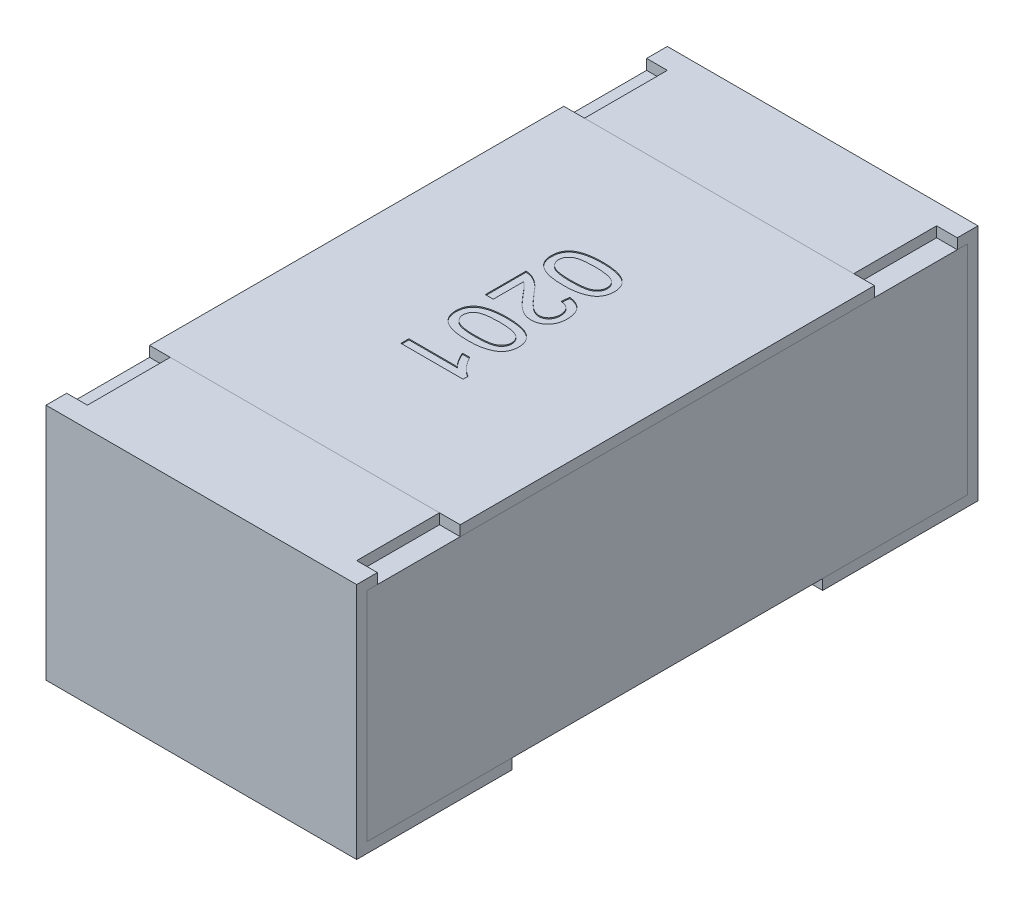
from build123d import *

# Parameters (mm, degrees)
BOSS_EXTRUDE2_DEPTH   = 0.15
BOSS_EXTRUDE2_2_DEPTH = 0.15
BOSS_EXTRUDE3_START   = -0.15
SKETCH5_W             = 0.58
SKETCH5_H             = 0.21
BOSS_EXTRUDE3_DEPTH   = 0.3
SKETCH6_W             = 0.02
SKETCH6_H             = 0.08
CUT_EXTRUDE1_DEPTH    = 0.01
SKETCH7_W             = 0.3
SKETCH7_H             = 0.4
BOSS_EXTRUDE4_DEPTH   = 0.01
TEXT0201_DEPTH        = 0.001


with BuildPart() as part:
    # Sketch4 → Boss-Extrude2 (new, symmetric)
    with BuildSketch(Plane(origin=(0, 0, 0), x_dir=(0, 0, -1), z_dir=(1, 0, 0))):
        Polygon((-0.3, 0.115), (-0.3, -0.115), (-0.15, -0.115), (-0.15, -0.105), (-0.29, -0.105), (-0.29, 0.105), (-0.2, 0.105), (-0.2, 0.115), align=None)
    extrude(amount=BOSS_EXTRUDE2_DEPTH, both=True)


with BuildPart() as body_2:
    # Sketch4 → Boss-Extrude2 2 (new, symmetric)
    with BuildSketch(Plane(origin=(0, 0, 0), x_dir=(0, 0, -1), z_dir=(1, 0, 0))):
        Polygon((0.2, 0.115), (0.3, 0.115), (0.3, -0.115), (0.15, -0.115), (0.15, -0.105), (0.29, -0.105), (0.29, 0.105), (0.2, 0.105), align=None)
    extrude(amount=BOSS_EXTRUDE2_2_DEPTH, both=True)


with BuildPart() as body_3:
    # Sketch5 → Boss-Extrude3 (new body)
    with BuildSketch(Plane(origin=(0, 0, 0), x_dir=(0, 0, -1), z_dir=(1, 0, 0)).offset(BOSS_EXTRUDE3_START)):
        Rectangle(SKETCH5_W, SKETCH5_H)
    extrude(amount=BOSS_EXTRUDE3_DEPTH)


with BuildPart() as cut_extrude1_tool:
    # Sketch6 → Cut-Extrude1 (new body)
    with BuildSketch(Plane(origin=(0, 0.115, 0), x_dir=(1, 0, 0), z_dir=(0, 1, 0))):
        with Locations((-0.14, 0.24)):
            Rectangle(SKETCH6_W, SKETCH6_H)
        with Locations((0.14, 0.24)):
            Rectangle(SKETCH6_W, SKETCH6_H)
        with Locations((0.14, -0.24)):
            Rectangle(SKETCH6_W, SKETCH6_H)
        with Locations((-0.14, -0.24)):
            Rectangle(SKETCH6_W, SKETCH6_H)
    extrude(amount=-CUT_EXTRUDE1_DEPTH)


with BuildPart() as part_1:
    add(part.part)

    # Cut-Extrude1: cut by cut_extrude1_tool
    add(cut_extrude1_tool.part, mode=Mode.SUBTRACT)


with BuildPart() as body_2_1:
    add(body_2.part)

    # Cut-Extrude1: cut by cut_extrude1_tool
    add(cut_extrude1_tool.part, mode=Mode.SUBTRACT)


with BuildPart() as body_4:
    # Sketch7 → Boss-Extrude4 (new body)
    with BuildSketch(Plane(origin=(0, 0.105, 0), x_dir=(1, 0, 0), z_dir=(0, 1, 0))):
        Rectangle(SKETCH7_W, SKETCH7_H)
    extrude(amount=BOSS_EXTRUDE4_DEPTH)

    # Sketch8 → TEXT0201 (cut)
    # profile 1 of 4: a face of its own
    with BuildSketch(Plane(origin=(0, 0.115, 0), x_dir=(1, 0, 0), z_dir=(0, 1, 0))):
        with BuildLine():
            add(Edge.make_bspline(
                [(-0.000766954, 0.088461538), (9.0501e-05, 0.088453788), (0.001769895, 0.088438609), (0.004227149, 0.088344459), (0.006560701, 0.08818008), (0.008768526, 0.087934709), (0.010855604, 0.087644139), (0.012818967, 0.087266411), (0.014662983, 0.086841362), (0.01638586, 0.086331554), (0.018001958, 0.085770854), (0.019510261, 0.085136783), (0.020901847, 0.084417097), (0.022214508, 0.083676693), (0.023386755, 0.082814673), (0.024492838, 0.081940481), (0.02546962, 0.080964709), (0.026349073, 0.079933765), (0.027124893, 0.078830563), (0.027794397, 0.07766144), (0.028385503, 0.07643076), (0.028830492, 0.075115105), (0.029193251, 0.073741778), (0.029460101, 0.07230021), (0.029617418, 0.070788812), (0.029633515, 0.069755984), (0.0296417, 0.069230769)],
                knots=[0, 0, 0, 0, 1.514715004, 2.966688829, 4.343277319, 5.646155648, 6.890271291, 8.064567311, 9.176982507, 10.231801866, 11.236819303, 12.197732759, 13.118802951, 14.00370591, 14.856056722, 15.686168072, 16.491905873, 17.290274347, 18.077650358, 18.870352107, 19.668187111, 20.485160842, 21.319455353, 22.17593919, 23.072426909, 24, 24, 24, 24], degree=3))
            add(Edge.make_bspline(
                [(0.0296417, 0.069230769), (0.029619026, 0.068460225), (0.029574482, 0.066946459), (0.029211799, 0.064736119), (0.028589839, 0.06265391), (0.027757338, 0.060700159), (0.026680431, 0.058917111), (0.025404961, 0.05730507), (0.023877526, 0.05592917), (0.022148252, 0.05474396), (0.020213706, 0.053727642), (0.018092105, 0.052818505), (0.015774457, 0.052003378), (0.013705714, 0.051406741), (0.011916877, 0.050988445), (0.010438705, 0.050733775), (0.008848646, 0.050498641), (0.007142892, 0.050331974), (0.005329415, 0.050162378), (0.003400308, 0.050078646), (0.00135688, 0.050014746), (-4.5738e-05, 0.050005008), (-0.000766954, 0.05)],
                knots=[0, 0, 0, 0, 1.134508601, 2.228787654, 3.287419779, 4.328790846, 5.347871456, 6.346850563, 7.345149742, 8.363256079, 9.427154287, 10.558404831, 11.760335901, 13.043439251, 13.7276639, 14.464993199, 15.251939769, 16.09452972, 16.988861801, 17.934185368, 18.937772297, 20, 20, 20, 20], degree=3))
            add(Edge.make_bspline(
                [(-0.000766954, 0.05), (-0.001620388, 0.050007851), (-0.00328774, 0.050023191), (-0.005725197, 0.050115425), (-0.008041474, 0.050287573), (-0.010239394, 0.050509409), (-0.012320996, 0.050808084), (-0.014281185, 0.051181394), (-0.016122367, 0.051612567), (-0.017846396, 0.052100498), (-0.019455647, 0.052668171), (-0.020957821, 0.053308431), (-0.022367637, 0.053994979), (-0.023658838, 0.05477371), (-0.024852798, 0.055603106), (-0.025953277, 0.056490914), (-0.026944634, 0.057455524), (-0.027821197, 0.058496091), (-0.028610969, 0.059591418), (-0.02928656, 0.060763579), (-0.029850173, 0.062009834), (-0.030321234, 0.063319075), (-0.030679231, 0.064699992), (-0.030945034, 0.066145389), (-0.031103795, 0.067664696), (-0.03111951, 0.068701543), (-0.031127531, 0.069230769)],
                knots=[0, 0, 0, 0, 1.50892112, 2.947974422, 4.311604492, 5.614840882, 6.853004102, 8.028299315, 9.14166105, 10.195403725, 11.194594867, 12.156325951, 13.08133133, 13.964490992, 14.819271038, 15.650088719, 16.461567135, 17.260614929, 18.05275699, 18.846133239, 19.648095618, 20.468123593, 21.303127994, 22.167306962, 23.06455749, 24, 24, 24, 24], degree=3))
            add(Edge.make_bspline(
                [(-0.031127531, 0.069230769), (-0.031107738, 0.069924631), (-0.031069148, 0.071277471), (-0.030806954, 0.073253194), (-0.03034548, 0.075107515), (-0.029726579, 0.076856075), (-0.028898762, 0.078479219), (-0.027891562, 0.079984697), (-0.026728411, 0.081402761), (-0.025810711, 0.082219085), (-0.025346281, 0.082632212)],
                knots=[0, 0, 0, 0, 1.10322584, 2.150986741, 3.161425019, 4.136713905, 5.093944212, 6.049774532, 7.013026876, 8, 8, 8, 8], degree=3))
            add(Edge.make_bspline(
                [(-0.025346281, 0.082632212), (-0.024660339, 0.08310773), (-0.023245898, 0.084088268), (-0.020834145, 0.085235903), (-0.018179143, 0.086259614), (-0.015228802, 0.08706304), (-0.012006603, 0.087692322), (-0.008506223, 0.088146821), (-0.004729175, 0.088404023), (-0.002117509, 0.088441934), (-0.000766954, 0.088461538)],
                knots=[0, 0, 0, 0, 0.779365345, 1.607084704, 2.489375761, 3.438383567, 4.461919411, 5.557722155, 6.737039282, 8, 8, 8, 8], degree=3))
        make_face()
        with BuildLine():
            add(Edge.make_bspline(
                [(-0.000742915, 0.080769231), (-0.001896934, 0.080761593), (-0.00410598, 0.080746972), (-0.007261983, 0.080594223), (-0.010109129, 0.080331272), (-0.012643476, 0.079983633), (-0.014868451, 0.079524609), (-0.016778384, 0.078948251), (-0.0183962, 0.078298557), (-0.019701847, 0.077494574), (-0.020766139, 0.076614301), (-0.021681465, 0.075705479), (-0.022459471, 0.074746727), (-0.023108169, 0.073744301), (-0.023599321, 0.072682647), (-0.023955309, 0.071573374), (-0.024160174, 0.070416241), (-0.02418961, 0.069628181), (-0.024204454, 0.069230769)],
                knots=[0, 0, 0, 0, 1.89448813, 3.626469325, 5.185477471, 6.587276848, 7.82441448, 8.910550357, 9.859733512, 10.6775885, 11.416198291, 12.123144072, 12.791880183, 13.439617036, 14.078171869, 14.70637855, 15.347637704, 16, 16, 16, 16], degree=3))
            add(Edge.make_bspline(
                [(-0.024204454, 0.069230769), (-0.024189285, 0.068833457), (-0.024159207, 0.068045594), (-0.023958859, 0.066885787), (-0.023584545, 0.065780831), (-0.023095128, 0.06472076), (-0.022461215, 0.063711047), (-0.021680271, 0.062757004), (-0.020765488, 0.061843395), (-0.019688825, 0.060967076), (-0.018377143, 0.060169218), (-0.016760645, 0.059507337), (-0.014847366, 0.058939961), (-0.012623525, 0.058478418), (-0.010093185, 0.058129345), (-0.007253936, 0.057867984), (-0.004101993, 0.057714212), (-0.001896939, 0.057699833), (-0.000742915, 0.057692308)],
                knots=[0, 0, 0, 0, 0.652509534, 1.29391342, 1.924290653, 2.562989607, 3.207355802, 3.876242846, 4.583348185, 5.32723334, 6.150888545, 7.094226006, 8.186903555, 9.424320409, 10.81992305, 12.379283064, 14.105084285, 16, 16, 16, 16], degree=3))
            add(Edge.make_bspline(
                [(-0.000742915, 0.057692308), (0.000387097, 0.057699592), (0.002552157, 0.057713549), (0.005647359, 0.057871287), (0.008446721, 0.058118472), (0.010952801, 0.058456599), (0.01316295, 0.058905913), (0.015081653, 0.059451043), (0.01670549, 0.060100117), (0.018048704, 0.060873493), (0.019157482, 0.061730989), (0.02009851, 0.062642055), (0.020923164, 0.063589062), (0.021568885, 0.064626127), (0.02209847, 0.065709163), (0.022452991, 0.066861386), (0.02268052, 0.068067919), (0.022705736, 0.068893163), (0.022718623, 0.069314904)],
                knots=[0, 0, 0, 0, 1.850145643, 3.544809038, 5.072983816, 6.450691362, 7.683229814, 8.76276662, 9.712991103, 10.538891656, 11.292051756, 12.001912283, 12.681449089, 13.342071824, 13.996410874, 14.649960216, 15.310061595, 16, 16, 16, 16], degree=3))
            add(Edge.make_bspline(
                [(0.022718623, 0.069314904), (0.022708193, 0.069712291), (0.022687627, 0.070495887), (0.022491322, 0.071643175), (0.022163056, 0.072730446), (0.021718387, 0.073770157), (0.021119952, 0.074736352), (0.020421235, 0.075667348), (0.019569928, 0.076519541), (0.018933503, 0.077033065), (0.018608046, 0.077295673)],
                knots=[0, 0, 0, 0, 1.021318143, 2.013908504, 2.982026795, 3.937174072, 4.91255697, 5.897578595, 6.924855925, 8, 8, 8, 8], degree=3))
            add(Edge.make_bspline(
                [(0.018608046, 0.077295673), (0.018130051, 0.077581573), (0.017120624, 0.078185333), (0.0153662, 0.078860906), (0.013361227, 0.07945768), (0.011074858, 0.079949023), (0.008511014, 0.080304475), (0.005672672, 0.080585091), (0.002555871, 0.08073086), (0.000387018, 0.080756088), (-0.000742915, 0.080769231)],
                knots=[0, 0, 0, 0, 0.671104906, 1.417232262, 2.260109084, 3.195198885, 4.23592645, 5.382417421, 6.636286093, 8, 8, 8, 8], degree=3))
        make_face(mode=Mode.SUBTRACT)
    # profile 2 of 4: a face of its own
    with BuildSketch(Plane(origin=(0, 0.115, 0), x_dir=(1, 0, 0), z_dir=(0, 1, 0))):
        with BuildLine():
            Line((-0.022665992, 0.004615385), (-0.0303583, 0.004615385))
            Line((-0.0303583, 0.004615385), (-0.0303583, 0.043846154))
            add(Edge.make_bspline(
                [(-0.0303583, 0.043846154), (-0.029901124, 0.043846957), (-0.028988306, 0.043848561), (-0.027638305, 0.043694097), (-0.026306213, 0.043452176), (-0.025451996, 0.043178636), (-0.025021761, 0.043040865)],
                knots=[0, 0, 0, 0, 1.01057331, 2.01775941, 3.001627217, 4, 4, 4, 4], degree=3))
            add(Edge.make_bspline(
                [(-0.025021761, 0.043040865), (-0.024318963, 0.042786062), (-0.02288795, 0.042267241), (-0.020818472, 0.041220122), (-0.018773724, 0.039968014), (-0.017097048, 0.038769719), (-0.01576726, 0.037666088), (-0.01471431, 0.036755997), (-0.013649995, 0.035730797), (-0.012555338, 0.034609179), (-0.011430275, 0.033397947), (-0.010269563, 0.032097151), (-0.009095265, 0.030690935), (-0.008316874, 0.02970927), (-0.007918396, 0.029206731)],
                knots=[0, 0, 0, 0, 1.204749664, 2.453068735, 3.731868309, 5.069624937, 5.772016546, 6.5184395, 7.31363639, 8.154361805, 9.045869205, 9.979533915, 10.965673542, 12, 12, 12, 12], degree=3))
            add(Edge.make_bspline(
                [(-0.007918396, 0.029206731), (-0.007268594, 0.028434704), (-0.006017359, 0.026948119), (-0.004160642, 0.024848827), (-0.002436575, 0.022931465), (-0.000814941, 0.021226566), (0.000688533, 0.019720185), (0.002070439, 0.018408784), (0.003326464, 0.017281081), (0.004502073, 0.016350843), (0.005612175, 0.015565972), (0.00669501, 0.014900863), (0.007769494, 0.014346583), (0.008832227, 0.013884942), (0.009887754, 0.013519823), (0.010939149, 0.013270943), (0.011975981, 0.013102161), (0.0126659, 0.013085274), (0.013007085, 0.013076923)],
                knots=[0, 0, 0, 0, 1.782554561, 3.432421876, 4.950675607, 6.337395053, 7.588547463, 8.709982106, 9.702713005, 10.569305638, 11.356701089, 12.103210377, 12.812277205, 13.490692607, 14.148717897, 14.782152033, 15.397739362, 16, 16, 16, 16], degree=3))
            add(Edge.make_bspline(
                [(0.013007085, 0.013076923), (0.013344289, 0.013085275), (0.014005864, 0.013101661), (0.014974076, 0.013257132), (0.015906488, 0.013473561), (0.016786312, 0.01382346), (0.017639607, 0.014239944), (0.018439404, 0.014774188), (0.019205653, 0.015392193), (0.019918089, 0.016099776), (0.020586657, 0.016872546), (0.021141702, 0.017736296), (0.021645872, 0.018636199), (0.022039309, 0.019601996), (0.022342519, 0.020625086), (0.022553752, 0.021703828), (0.022690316, 0.022841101), (0.022709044, 0.023617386), (0.022718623, 0.024014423)],
                knots=[0, 0, 0, 0, 0.988220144, 1.938834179, 2.870816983, 3.789593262, 4.709270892, 5.651202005, 6.603702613, 7.592551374, 8.593130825, 9.593710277, 10.598146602, 11.615084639, 12.644976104, 13.72352976, 14.835681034, 16, 16, 16, 16], degree=3))
            add(Edge.make_bspline(
                [(0.022718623, 0.024014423), (0.022709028, 0.024431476), (0.022690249, 0.025247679), (0.022554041, 0.026440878), (0.022344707, 0.027573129), (0.022030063, 0.028640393), (0.021618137, 0.029640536), (0.021127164, 0.030580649), (0.020545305, 0.031457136), (0.0198695, 0.032255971), (0.019133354, 0.032995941), (0.018301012, 0.033621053), (0.017416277, 0.034167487), (0.016451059, 0.034598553), (0.015426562, 0.034950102), (0.014327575, 0.035203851), (0.013158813, 0.035342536), (0.012358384, 0.035370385), (0.011949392, 0.035384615)],
                knots=[0, 0, 0, 0, 1.131353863, 2.214142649, 3.254522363, 4.251993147, 5.226998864, 6.184887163, 7.125534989, 8.07474883, 9.020220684, 9.950764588, 10.892228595, 11.83594911, 12.812226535, 13.827427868, 14.889891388, 16, 16, 16, 16], degree=3))
            Line((0.011949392, 0.035384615), (0.012718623, 0.043076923))
            add(Edge.make_bspline(
                [(0.012718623, 0.043076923), (0.013389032, 0.042998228), (0.014693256, 0.042845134), (0.016582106, 0.042463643), (0.018339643, 0.041928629), (0.019988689, 0.041286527), (0.021509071, 0.040487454), (0.022906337, 0.039561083), (0.024186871, 0.038508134), (0.025320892, 0.037310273), (0.026355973, 0.036013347), (0.027226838, 0.034585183), (0.02798143, 0.033058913), (0.028591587, 0.031423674), (0.029059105, 0.029680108), (0.029393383, 0.02783093), (0.029599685, 0.025874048), (0.029627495, 0.024531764), (0.0296417, 0.023846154)],
                knots=[0, 0, 0, 0, 1.130902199, 2.200072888, 3.223843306, 4.206271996, 5.161246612, 6.096017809, 7.01151883, 7.932713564, 8.85544837, 9.78703152, 10.729845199, 11.705020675, 12.706647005, 13.750927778, 14.851223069, 16, 16, 16, 16], degree=3))
            add(Edge.make_bspline(
                [(0.0296417, 0.023846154), (0.029629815, 0.023152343), (0.029606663, 0.021800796), (0.029369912, 0.019831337), (0.029000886, 0.017973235), (0.028487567, 0.016219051), (0.027809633, 0.014578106), (0.026993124, 0.013044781), (0.026024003, 0.011623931), (0.024906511, 0.010334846), (0.023686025, 0.009172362), (0.022382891, 0.008155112), (0.021007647, 0.007299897), (0.019564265, 0.006592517), (0.018043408, 0.00605087), (0.016450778, 0.00567392), (0.014790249, 0.00541661), (0.013657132, 0.005395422), (0.0130792, 0.005384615)],
                knots=[0, 0, 0, 0, 1.195163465, 2.32818547, 3.412777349, 4.456995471, 5.472468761, 6.467096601, 7.445683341, 8.429710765, 9.401551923, 10.346206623, 11.27346832, 12.187474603, 13.111233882, 14.049000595, 15.004916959, 16, 16, 16, 16], degree=3))
            add(Edge.make_bspline(
                [(0.0130792, 0.005384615), (0.01248538, 0.005400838), (0.011296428, 0.005433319), (0.009521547, 0.005696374), (0.007760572, 0.006119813), (0.005999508, 0.006707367), (0.004236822, 0.007525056), (0.002430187, 0.008532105), (0.00059298, 0.00979078), (-0.000980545, 0.01098443), (-0.002290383, 0.012108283), (-0.003370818, 0.013104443), (-0.004523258, 0.014256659), (-0.005770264, 0.015534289), (-0.007093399, 0.016963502), (-0.008512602, 0.018518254), (-0.009997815, 0.020229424), (-0.011012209, 0.02141754), (-0.011536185, 0.02203125)],
                knots=[0, 0, 0, 0, 0.927016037, 1.85607784, 2.795426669, 3.753038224, 4.749807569, 5.825438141, 6.979408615, 8.224540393, 8.907917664, 9.673913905, 10.518929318, 11.452509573, 12.461825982, 13.560287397, 14.739790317, 16, 16, 16, 16], degree=3))
            add(Edge.make_bspline(
                [(-0.011536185, 0.02203125), (-0.011964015, 0.022556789), (-0.012779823, 0.023558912), (-0.013962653, 0.024984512), (-0.015046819, 0.02626181), (-0.015998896, 0.027418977), (-0.016856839, 0.028416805), (-0.017603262, 0.029276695), (-0.018248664, 0.02999011), (-0.019238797, 0.031077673), (-0.020638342, 0.032465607), (-0.022008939, 0.033480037), (-0.022665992, 0.033966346)],
                knots=[0, 0, 0, 0, 1.24205232, 2.36840259, 3.395101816, 4.312728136, 5.114777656, 5.806942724, 6.399692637, 6.87784234, 8.503262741, 10, 10, 10, 10], degree=3))
            Line((-0.022665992, 0.033966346), (-0.022665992, 0.004615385))
        make_face()
    # profile 3 of 4: a face of its own
    with BuildSketch(Plane(origin=(0, 0.115, 0), x_dir=(1, 0, 0), z_dir=(0, 1, 0))):
        with BuildLine():
            add(Edge.make_bspline(
                [(-0.000766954, -0.003846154), (9.0501e-05, -0.003853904), (0.001769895, -0.003869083), (0.004227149, -0.003963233), (0.006560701, -0.004127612), (0.008768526, -0.004372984), (0.010855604, -0.004663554), (0.012818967, -0.005041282), (0.014662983, -0.00546633), (0.01638586, -0.005976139), (0.018001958, -0.006536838), (0.019510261, -0.007170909), (0.020901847, -0.007890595), (0.022214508, -0.008630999), (0.023386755, -0.009493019), (0.024492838, -0.010367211), (0.02546962, -0.011342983), (0.026349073, -0.012373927), (0.027124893, -0.013477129), (0.027794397, -0.014646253), (0.028385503, -0.015876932), (0.028830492, -0.017192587), (0.029193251, -0.018565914), (0.029460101, -0.020007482), (0.029617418, -0.02151888), (0.029633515, -0.022551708), (0.0296417, -0.023076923)],
                knots=[0, 0, 0, 0, 1.514715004, 2.966688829, 4.343277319, 5.646155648, 6.890271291, 8.064567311, 9.176982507, 10.231801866, 11.236819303, 12.197732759, 13.118802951, 14.00370591, 14.856056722, 15.686168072, 16.491905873, 17.290274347, 18.077650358, 18.870352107, 19.668187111, 20.485160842, 21.319455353, 22.17593919, 23.072426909, 24, 24, 24, 24], degree=3))
            add(Edge.make_bspline(
                [(0.0296417, -0.023076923), (0.029619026, -0.023847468), (0.029574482, -0.025361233), (0.029211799, -0.027571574), (0.028589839, -0.029653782), (0.027757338, -0.031607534), (0.026680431, -0.033390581), (0.025404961, -0.035002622), (0.023877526, -0.036378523), (0.022148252, -0.037563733), (0.020213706, -0.03858005), (0.018092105, -0.039489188), (0.015774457, -0.040304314), (0.013705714, -0.040900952), (0.011916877, -0.041319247), (0.010438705, -0.041573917), (0.008848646, -0.041809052), (0.007142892, -0.041975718), (0.005329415, -0.042145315), (0.003400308, -0.042229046), (0.00135688, -0.042292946), (-4.5738e-05, -0.042302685), (-0.000766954, -0.042307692)],
                knots=[0, 0, 0, 0, 1.134508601, 2.228787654, 3.287419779, 4.328790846, 5.347871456, 6.346850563, 7.345149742, 8.363256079, 9.427154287, 10.558404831, 11.760335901, 13.043439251, 13.7276639, 14.464993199, 15.251939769, 16.09452972, 16.988861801, 17.934185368, 18.937772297, 20, 20, 20, 20], degree=3))
            add(Edge.make_bspline(
                [(-0.000766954, -0.042307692), (-0.001620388, -0.042299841), (-0.00328774, -0.042284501), (-0.005725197, -0.042192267), (-0.008041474, -0.04202012), (-0.010239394, -0.041798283), (-0.012320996, -0.041499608), (-0.014281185, -0.041126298), (-0.016122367, -0.040695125), (-0.017846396, -0.040207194), (-0.019455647, -0.039639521), (-0.020957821, -0.038999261), (-0.022367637, -0.038312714), (-0.023658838, -0.037533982), (-0.024852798, -0.036704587), (-0.025953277, -0.035816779), (-0.026944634, -0.034852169), (-0.027821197, -0.033811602), (-0.028610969, -0.032716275), (-0.02928656, -0.031544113), (-0.029850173, -0.030297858), (-0.030321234, -0.028988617), (-0.030679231, -0.027607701), (-0.030945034, -0.026162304), (-0.031103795, -0.024642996), (-0.03111951, -0.02360615), (-0.031127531, -0.023076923)],
                knots=[0, 0, 0, 0, 1.50892112, 2.947974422, 4.311604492, 5.614840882, 6.853004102, 8.028299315, 9.14166105, 10.195403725, 11.194594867, 12.156325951, 13.08133133, 13.964490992, 14.819271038, 15.650088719, 16.461567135, 17.260614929, 18.05275699, 18.846133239, 19.648095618, 20.468123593, 21.303127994, 22.167306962, 23.06455749, 24, 24, 24, 24], degree=3))
            add(Edge.make_bspline(
                [(-0.031127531, -0.023076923), (-0.031107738, -0.022383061), (-0.031069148, -0.021030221), (-0.030806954, -0.019054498), (-0.03034548, -0.017200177), (-0.029726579, -0.015451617), (-0.028898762, -0.013828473), (-0.027891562, -0.012322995), (-0.026728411, -0.010904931), (-0.025810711, -0.010088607), (-0.025346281, -0.009675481)],
                knots=[0, 0, 0, 0, 1.10322584, 2.150986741, 3.161425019, 4.136713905, 5.093944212, 6.049774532, 7.013026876, 8, 8, 8, 8], degree=3))
            add(Edge.make_bspline(
                [(-0.025346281, -0.009675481), (-0.024660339, -0.009199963), (-0.023245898, -0.008219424), (-0.020834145, -0.007071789), (-0.018179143, -0.006048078), (-0.015228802, -0.005244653), (-0.012006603, -0.00461537), (-0.008506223, -0.004160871), (-0.004729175, -0.00390367), (-0.002117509, -0.003865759), (-0.000766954, -0.003846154)],
                knots=[0, 0, 0, 0, 0.779365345, 1.607084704, 2.489375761, 3.438383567, 4.461919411, 5.557722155, 6.737039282, 8, 8, 8, 8], degree=3))
        make_face()
        with BuildLine():
            add(Edge.make_bspline(
                [(-0.000742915, -0.011538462), (-0.001896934, -0.011546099), (-0.00410598, -0.01156072), (-0.007261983, -0.011713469), (-0.010109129, -0.01197642), (-0.012643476, -0.012324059), (-0.014868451, -0.012783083), (-0.016778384, -0.013359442), (-0.0183962, -0.014009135), (-0.019701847, -0.014813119), (-0.020766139, -0.015693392), (-0.021681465, -0.016602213), (-0.022459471, -0.017560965), (-0.023108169, -0.018563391), (-0.023599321, -0.019625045), (-0.023955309, -0.020734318), (-0.024160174, -0.021891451), (-0.02418961, -0.022679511), (-0.024204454, -0.023076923)],
                knots=[0, 0, 0, 0, 1.89448813, 3.626469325, 5.185477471, 6.587276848, 7.82441448, 8.910550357, 9.859733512, 10.6775885, 11.416198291, 12.123144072, 12.791880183, 13.439617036, 14.078171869, 14.70637855, 15.347637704, 16, 16, 16, 16], degree=3))
            add(Edge.make_bspline(
                [(-0.024204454, -0.023076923), (-0.024189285, -0.023474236), (-0.024159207, -0.024262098), (-0.023958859, -0.025421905), (-0.023584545, -0.026526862), (-0.023095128, -0.027586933), (-0.022461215, -0.028596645), (-0.021680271, -0.029550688), (-0.020765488, -0.030464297), (-0.019688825, -0.031340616), (-0.018377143, -0.032138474), (-0.016760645, -0.032800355), (-0.014847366, -0.033367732), (-0.012623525, -0.033829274), (-0.010093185, -0.034178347), (-0.007253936, -0.034439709), (-0.004101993, -0.03459348), (-0.001896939, -0.034607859), (-0.000742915, -0.034615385)],
                knots=[0, 0, 0, 0, 0.652509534, 1.29391342, 1.924290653, 2.562989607, 3.207355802, 3.876242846, 4.583348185, 5.32723334, 6.150888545, 7.094226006, 8.186903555, 9.424320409, 10.81992305, 12.379283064, 14.105084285, 16, 16, 16, 16], degree=3))
            add(Edge.make_bspline(
                [(-0.000742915, -0.034615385), (0.000387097, -0.0346081), (0.002552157, -0.034594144), (0.005647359, -0.034436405), (0.008446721, -0.034189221), (0.010952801, -0.033851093), (0.01316295, -0.033401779), (0.015081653, -0.03285665), (0.01670549, -0.032207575), (0.018048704, -0.031434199), (0.019157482, -0.030576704), (0.02009851, -0.029665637), (0.020923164, -0.02871863), (0.021568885, -0.027681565), (0.02209847, -0.02659853), (0.022452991, -0.025446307), (0.02268052, -0.024239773), (0.022705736, -0.02341453), (0.022718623, -0.022992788)],
                knots=[0, 0, 0, 0, 1.850145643, 3.544809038, 5.072983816, 6.450691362, 7.683229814, 8.76276662, 9.712991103, 10.538891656, 11.292051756, 12.001912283, 12.681449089, 13.342071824, 13.996410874, 14.649960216, 15.310061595, 16, 16, 16, 16], degree=3))
            add(Edge.make_bspline(
                [(0.022718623, -0.022992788), (0.022708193, -0.022595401), (0.022687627, -0.021811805), (0.022491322, -0.020664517), (0.022163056, -0.019577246), (0.021718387, -0.018537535), (0.021119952, -0.01757134), (0.020421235, -0.016640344), (0.019569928, -0.015788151), (0.018933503, -0.015274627), (0.018608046, -0.015012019)],
                knots=[0, 0, 0, 0, 1.021318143, 2.013908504, 2.982026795, 3.937174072, 4.91255697, 5.897578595, 6.924855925, 8, 8, 8, 8], degree=3))
            add(Edge.make_bspline(
                [(0.018608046, -0.015012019), (0.018130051, -0.014726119), (0.017120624, -0.014122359), (0.0153662, -0.013446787), (0.013361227, -0.012850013), (0.011074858, -0.01235867), (0.008511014, -0.012003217), (0.005672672, -0.011722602), (0.002555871, -0.011576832), (0.000387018, -0.011551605), (-0.000742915, -0.011538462)],
                knots=[0, 0, 0, 0, 0.671104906, 1.417232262, 2.260109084, 3.195198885, 4.23592645, 5.382417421, 6.636286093, 8, 8, 8, 8], degree=3))
        make_face(mode=Mode.SUBTRACT)
    # profile 4 of 4: a face of its own
    with BuildSketch(Plane(origin=(0, 0.115, 0), x_dir=(1, 0, 0), z_dir=(0, 1, 0))):
        with BuildLine():
            Line((-0.0303583, -0.076923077), (-0.0303583, -0.069230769))
            Line((-0.0303583, -0.069230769), (0.016396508, -0.069230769))
            add(Edge.make_bspline(
                [(0.016396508, -0.069230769), (0.015969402, -0.06878782), (0.015081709, -0.067867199), (0.013824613, -0.066311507), (0.012556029, -0.064575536), (0.011319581, -0.062688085), (0.010178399, -0.060749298), (0.009137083, -0.058881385), (0.008260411, -0.057110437), (0.007780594, -0.055944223), (0.007550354, -0.055384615)],
                knots=[0, 0, 0, 0, 0.89334793, 1.85672577, 2.901900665, 4.015525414, 5.132247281, 6.168817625, 7.121308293, 8, 8, 8, 8], degree=3))
            Line((0.007550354, -0.055384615), (0.0146417, -0.055384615))
            add(Edge.make_bspline(
                [(0.0146417, -0.055384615), (0.015136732, -0.056345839), (0.016112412, -0.058240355), (0.017797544, -0.060916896), (0.019624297, -0.063415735), (0.021592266, -0.065695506), (0.023603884, -0.067739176), (0.025633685, -0.069461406), (0.027607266, -0.070902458), (0.028983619, -0.071625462), (0.0296417, -0.071971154)],
                knots=[0, 0, 0, 0, 1.141258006, 2.249351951, 3.335817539, 4.406819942, 5.426913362, 6.360259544, 7.215985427, 8, 8, 8, 8], degree=3))
            Line((0.0296417, -0.071971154), (0.0296417, -0.076923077))
            Line((0.0296417, -0.076923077), (-0.0303583, -0.076923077))
        make_face()
    extrude(amount=-TEXT0201_DEPTH, mode=Mode.SUBTRACT)


solid = Compound([body_3.part, part_1.part, body_2_1.part, body_4.part])
